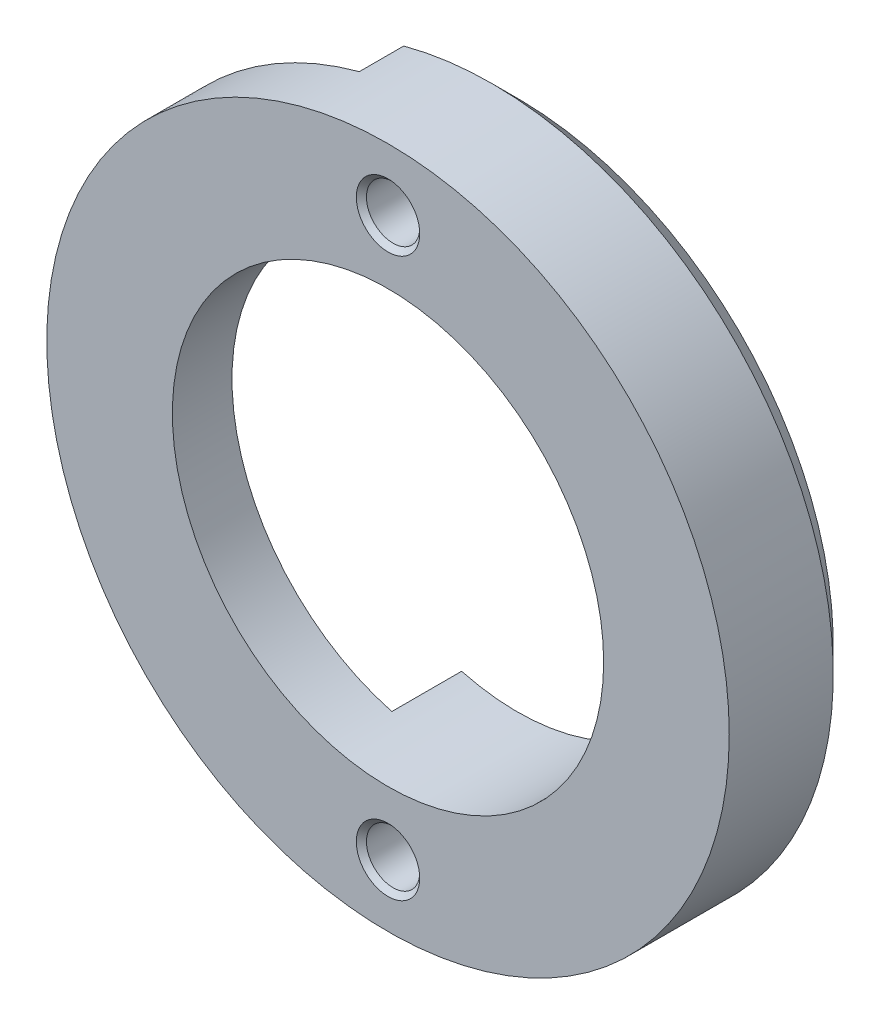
ISO-10303-21;
HEADER;
FILE_DESCRIPTION(('STEP AP214'),'2;1');
FILE_NAME('part.step','',(''),(''),'','','');
FILE_SCHEMA(('AUTOMOTIVE_DESIGN { 1 0 10303 214 1 1 1 1 }'));
ENDSEC;
DATA;
#1=APPLICATION_CONTEXT('core data for automotive mechanical design processes');
#2=APPLICATION_PROTOCOL_DEFINITION('international standard','automotive_design',2000,#1);
#3=PRODUCT_CONTEXT('',#1,'mechanical');
#4=PRODUCT('Part','Part','',(#3));
#5=PRODUCT_RELATED_PRODUCT_CATEGORY('part','',(#4));
#6=PRODUCT_DEFINITION_FORMATION('','',#4);
#7=PRODUCT_DEFINITION_CONTEXT('part definition',#1,'design');
#8=PRODUCT_DEFINITION('design','',#6,#7);
#9=PRODUCT_DEFINITION_SHAPE('','',#8);
#10=(LENGTH_UNIT() NAMED_UNIT(*) SI_UNIT(.MILLI.,.METRE.));
#11=(NAMED_UNIT(*) PLANE_ANGLE_UNIT() SI_UNIT($,.RADIAN.));
#12=(NAMED_UNIT(*) SI_UNIT($,.STERADIAN.) SOLID_ANGLE_UNIT());
#13=UNCERTAINTY_MEASURE_WITH_UNIT(LENGTH_MEASURE(1.E-05),#10,'distance_accuracy_value','');
#14=(GEOMETRIC_REPRESENTATION_CONTEXT(3) GLOBAL_UNCERTAINTY_ASSIGNED_CONTEXT((#13)) GLOBAL_UNIT_ASSIGNED_CONTEXT((#10,
#11,#12)) REPRESENTATION_CONTEXT('',''));
#15=CARTESIAN_POINT('',(0.,0.,0.));
#16=DIRECTION('',(0.,0.,1.));
#17=DIRECTION('',(1.,0.,0.));
#18=AXIS2_PLACEMENT_3D('',#15,#16,#17);
#19=CARTESIAN_POINT('',(0.,0.,0.));
#20=DIRECTION('',(0.,0.,1.));
#21=DIRECTION('',(1.,0.,0.));
#22=AXIS2_PLACEMENT_3D('',#19,#20,#21);
#23=PLANE('',#22);
#24=DIRECTION('',(0.258819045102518,0.965925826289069,0.));
#25=VECTOR('',#24,1.);
#26=CARTESIAN_POINT('',(-4.3999237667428,-16.4207390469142,0.));
#27=LINE('',#26,#25);
#28=CARTESIAN_POINT('',(-6.96223231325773,-25.983404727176,0.));
#29=VERTEX_POINT('',#28);
#30=CARTESIAN_POINT('',(-4.3999237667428,-16.4207390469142,0.));
#31=VERTEX_POINT('',#30);
#32=EDGE_CURVE('E95',#29,#31,#27,.T.);
#33=ORIENTED_EDGE('',*,*,#32,.F.);
#34=CARTESIAN_POINT('',(0.,0.,0.));
#35=DIRECTION('',(0.,0.,1.));
#36=DIRECTION('',(1.,0.,0.));
#37=AXIS2_PLACEMENT_3D('',#34,#35,#36);
#38=CIRCLE('',#37,26.9);
#39=CARTESIAN_POINT('',(-6.96223231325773,25.983404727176,0.));
#40=VERTEX_POINT('',#39);
#41=EDGE_CURVE('E83',#40,#29,#38,.T.);
#42=ORIENTED_EDGE('',*,*,#41,.F.);
#43=DIRECTION('',(-0.258819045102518,0.965925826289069,0.));
#44=VECTOR('',#43,1.);
#45=CARTESIAN_POINT('',(-4.3999237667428,16.4207390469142,0.));
#46=LINE('',#45,#44);
#47=CARTESIAN_POINT('',(-4.3999237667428,16.4207390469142,0.));
#48=VERTEX_POINT('',#47);
#49=EDGE_CURVE('E92',#48,#40,#46,.T.);
#50=ORIENTED_EDGE('',*,*,#49,.F.);
#51=CARTESIAN_POINT('',(0.,0.,0.));
#52=DIRECTION('',(0.,0.,1.));
#53=DIRECTION('',(1.,0.,0.));
#54=AXIS2_PLACEMENT_3D('',#51,#52,#53);
#55=CIRCLE('',#54,17.);
#56=EDGE_CURVE('E150',#48,#31,#55,.T.);
#57=ORIENTED_EDGE('',*,*,#56,.T.);
#58=EDGE_LOOP('',(#33,#42,#50,#57));
#59=FACE_BOUND('',#58,.T.);
#60=ADVANCED_FACE('F38',(#59),#23,.F.);
#61=CARTESIAN_POINT('',(0.,0.,4.7));
#62=DIRECTION('',(0.,0.,1.));
#63=DIRECTION('',(1.,0.,0.));
#64=AXIS2_PLACEMENT_3D('',#61,#62,#63);
#65=PLANE('',#64);
#66=CARTESIAN_POINT('',(0.,-22.,4.7));
#67=DIRECTION('',(0.,0.,1.));
#68=DIRECTION('',(1.,0.,0.));
#69=AXIS2_PLACEMENT_3D('',#66,#67,#68);
#70=CIRCLE('',#69,2.5);
#71=CARTESIAN_POINT('',(2.5,-22.,4.7));
#72=VERTEX_POINT('',#71);
#73=EDGE_CURVE('E290',#72,#72,#70,.T.);
#74=ORIENTED_EDGE('',*,*,#73,.F.);
#75=EDGE_LOOP('',(#74));
#76=FACE_BOUND('',#75,.T.);
#77=CARTESIAN_POINT('',(0.,22.,4.7));
#78=DIRECTION('',(0.,0.,1.));
#79=DIRECTION('',(1.,0.,0.));
#80=AXIS2_PLACEMENT_3D('',#77,#78,#79);
#81=CIRCLE('',#80,2.5);
#82=CARTESIAN_POINT('',(2.5,22.,4.7));
#83=VERTEX_POINT('',#82);
#84=EDGE_CURVE('E107',#83,#83,#81,.T.);
#85=ORIENTED_EDGE('',*,*,#84,.F.);
#86=EDGE_LOOP('',(#85));
#87=FACE_BOUND('',#86,.T.);
#88=CARTESIAN_POINT('',(0.,0.,4.7));
#89=DIRECTION('',(0.,0.,1.));
#90=DIRECTION('',(1.,0.,0.));
#91=AXIS2_PLACEMENT_3D('',#88,#89,#90);
#92=CIRCLE('',#91,26.9);
#93=CARTESIAN_POINT('',(26.9,0.,4.7));
#94=VERTEX_POINT('',#93);
#95=EDGE_CURVE('E96',#94,#94,#92,.T.);
#96=ORIENTED_EDGE('',*,*,#95,.T.);
#97=EDGE_LOOP('',(#96));
#98=FACE_BOUND('',#97,.T.);
#99=CARTESIAN_POINT('',(0.,0.,4.7));
#100=DIRECTION('',(0.,0.,1.));
#101=DIRECTION('',(1.,0.,0.));
#102=AXIS2_PLACEMENT_3D('',#99,#100,#101);
#103=CIRCLE('',#102,17.);
#104=CARTESIAN_POINT('',(17.,0.,4.7));
#105=VERTEX_POINT('',#104);
#106=EDGE_CURVE('E97',#105,#105,#103,.T.);
#107=ORIENTED_EDGE('',*,*,#106,.F.);
#108=EDGE_LOOP('',(#107));
#109=FACE_BOUND('',#108,.T.);
#110=ADVANCED_FACE('F157',(#76,#87,#98,#109),#65,.T.);
#111=CARTESIAN_POINT('',(0.,0.,4.7));
#112=DIRECTION('',(0.,0.,-1.));
#113=DIRECTION('',(-1.,0.,0.));
#114=AXIS2_PLACEMENT_3D('',#111,#112,#113);
#115=CYLINDRICAL_SURFACE('',#114,26.9);
#116=ORIENTED_EDGE('',*,*,#95,.F.);
#117=EDGE_LOOP('',(#116));
#118=FACE_BOUND('',#117,.T.);
#119=DIRECTION('',(0.,0.,1.));
#120=VECTOR('',#119,1.);
#121=CARTESIAN_POINT('',(-6.96223231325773,-25.983404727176,-5.5));
#122=LINE('',#121,#120);
#123=CARTESIAN_POINT('',(-6.96223231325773,-25.983404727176,-3.5));
#124=VERTEX_POINT('',#123);
#125=EDGE_CURVE('E88',#124,#29,#122,.T.);
#126=ORIENTED_EDGE('',*,*,#125,.F.);
#127=CARTESIAN_POINT('',(0.,0.,-3.5));
#128=DIRECTION('',(0.,0.,-1.));
#129=DIRECTION('',(-1.,0.,0.));
#130=AXIS2_PLACEMENT_3D('',#127,#128,#129);
#131=CIRCLE('',#130,26.9);
#132=CARTESIAN_POINT('',(-6.96223231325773,25.983404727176,-3.49999999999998));
#133=VERTEX_POINT('',#132);
#134=EDGE_CURVE('E46',#124,#133,#131,.F.);
#135=ORIENTED_EDGE('',*,*,#134,.T.);
#136=DIRECTION('',(0.,0.,1.));
#137=VECTOR('',#136,1.);
#138=CARTESIAN_POINT('',(-6.96223231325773,25.983404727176,-5.5));
#139=LINE('',#138,#137);
#140=EDGE_CURVE('E81',#133,#40,#139,.T.);
#141=ORIENTED_EDGE('',*,*,#140,.T.);
#142=ORIENTED_EDGE('',*,*,#41,.T.);
#143=EDGE_LOOP('',(#126,#135,#141,#142));
#144=FACE_BOUND('',#143,.T.);
#145=ADVANCED_FACE('F40',(#118,#144),#115,.T.);
#146=CARTESIAN_POINT('',(0.,0.,4.7));
#147=DIRECTION('',(0.,0.,-1.));
#148=DIRECTION('',(-1.,0.,0.));
#149=AXIS2_PLACEMENT_3D('',#146,#147,#148);
#150=CYLINDRICAL_SURFACE('',#149,17.);
#151=ORIENTED_EDGE('',*,*,#106,.T.);
#152=EDGE_LOOP('',(#151));
#153=FACE_BOUND('',#152,.T.);
#154=ORIENTED_EDGE('',*,*,#56,.F.);
#155=DIRECTION('',(0.,0.,1.));
#156=VECTOR('',#155,1.);
#157=CARTESIAN_POINT('',(-4.3999237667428,16.4207390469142,-5.5));
#158=LINE('',#157,#156);
#159=CARTESIAN_POINT('',(-4.3999237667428,16.4207390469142,-5.5));
#160=VERTEX_POINT('',#159);
#161=EDGE_CURVE('E87',#160,#48,#158,.T.);
#162=ORIENTED_EDGE('',*,*,#161,.F.);
#163=CARTESIAN_POINT('',(0.,0.,-5.5));
#164=DIRECTION('',(0.,0.,1.));
#165=DIRECTION('',(-1.,0.,0.));
#166=AXIS2_PLACEMENT_3D('',#163,#164,#165);
#167=CIRCLE('',#166,17.);
#168=CARTESIAN_POINT('',(-4.3999237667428,-16.4207390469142,-5.5));
#169=VERTEX_POINT('',#168);
#170=EDGE_CURVE('E104',#169,#160,#167,.T.);
#171=ORIENTED_EDGE('',*,*,#170,.F.);
#172=DIRECTION('',(0.,0.,1.));
#173=VECTOR('',#172,1.);
#174=CARTESIAN_POINT('',(-4.3999237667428,-16.4207390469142,-5.5));
#175=LINE('',#174,#173);
#176=EDGE_CURVE('E126',#169,#31,#175,.T.);
#177=ORIENTED_EDGE('',*,*,#176,.T.);
#178=EDGE_LOOP('',(#154,#162,#171,#177));
#179=FACE_BOUND('',#178,.T.);
#180=ADVANCED_FACE('F154',(#153,#179),#150,.F.);
#181=CARTESIAN_POINT('',(-4.3999237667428,16.4207390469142,-5.5));
#182=DIRECTION('',(0.965925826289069,0.258819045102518,0.));
#183=DIRECTION('',(-0.258819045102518,0.965925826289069,0.));
#184=AXIS2_PLACEMENT_3D('',#181,#182,#183);
#185=PLANE('',#184);
#186=ORIENTED_EDGE('',*,*,#140,.F.);
#187=DIRECTION('',(-0.183012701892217,0.68301270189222,0.707106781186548));
#188=VECTOR('',#187,1.);
#189=CARTESIAN_POINT('',(0.,0.,-30.4));
#190=LINE('',#189,#188);
#191=CARTESIAN_POINT('',(-6.4445942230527,24.0515530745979,-5.49999999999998));
#192=VERTEX_POINT('',#191);
#193=EDGE_CURVE('E11',#133,#192,#190,.F.);
#194=ORIENTED_EDGE('',*,*,#193,.T.);
#195=DIRECTION('',(-0.258819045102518,0.965925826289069,0.));
#196=VECTOR('',#195,1.);
#197=CARTESIAN_POINT('',(-4.3999237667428,16.4207390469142,-5.5));
#198=LINE('',#197,#196);
#199=EDGE_CURVE('E201',#160,#192,#198,.T.);
#200=ORIENTED_EDGE('',*,*,#199,.F.);
#201=ORIENTED_EDGE('',*,*,#161,.T.);
#202=ORIENTED_EDGE('',*,*,#49,.T.);
#203=EDGE_LOOP('',(#186,#194,#200,#201,#202));
#204=FACE_BOUND('',#203,.T.);
#205=ADVANCED_FACE('F100',(#204),#185,.F.);
#206=CARTESIAN_POINT('',(-4.3999237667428,-16.4207390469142,-5.5));
#207=DIRECTION('',(0.965925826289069,-0.258819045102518,0.));
#208=DIRECTION('',(0.258819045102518,0.965925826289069,0.));
#209=AXIS2_PLACEMENT_3D('',#206,#207,#208);
#210=PLANE('',#209);
#211=DIRECTION('',(0.258819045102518,0.965925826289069,0.));
#212=VECTOR('',#211,1.);
#213=CARTESIAN_POINT('',(-4.3999237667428,-16.4207390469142,-5.5));
#214=LINE('',#213,#212);
#215=CARTESIAN_POINT('',(-6.4445942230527,-24.0515530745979,-5.49999999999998));
#216=VERTEX_POINT('',#215);
#217=EDGE_CURVE('E129',#216,#169,#214,.T.);
#218=ORIENTED_EDGE('',*,*,#217,.F.);
#219=DIRECTION('',(0.183012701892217,0.68301270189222,-0.707106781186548));
#220=VECTOR('',#219,1.);
#221=CARTESIAN_POINT('',(0.,0.,-30.4));
#222=LINE('',#221,#220);
#223=EDGE_CURVE('E60',#216,#124,#222,.F.);
#224=ORIENTED_EDGE('',*,*,#223,.T.);
#225=ORIENTED_EDGE('',*,*,#125,.T.);
#226=ORIENTED_EDGE('',*,*,#32,.T.);
#227=ORIENTED_EDGE('',*,*,#176,.F.);
#228=EDGE_LOOP('',(#218,#224,#225,#226,#227));
#229=FACE_BOUND('',#228,.T.);
#230=ADVANCED_FACE('F173',(#229),#210,.F.);
#231=CARTESIAN_POINT('',(0.,0.,-5.5));
#232=DIRECTION('',(0.,0.,-1.));
#233=DIRECTION('',(-1.,0.,0.));
#234=AXIS2_PLACEMENT_3D('',#231,#232,#233);
#235=PLANE('',#234);
#236=CARTESIAN_POINT('',(0.,-22.,-5.5));
#237=DIRECTION('',(0.,0.,-1.));
#238=DIRECTION('',(-1.,0.,0.));
#239=AXIS2_PLACEMENT_3D('',#236,#237,#238);
#240=CIRCLE('',#239,2.1);
#241=CARTESIAN_POINT('',(-2.1,-22.,-5.5));
#242=VERTEX_POINT('',#241);
#243=EDGE_CURVE('E286',#242,#242,#240,.T.);
#244=ORIENTED_EDGE('',*,*,#243,.F.);
#245=EDGE_LOOP('',(#244));
#246=FACE_BOUND('',#245,.T.);
#247=CARTESIAN_POINT('',(0.,22.,-5.5));
#248=DIRECTION('',(0.,0.,-1.));
#249=DIRECTION('',(-1.,0.,0.));
#250=AXIS2_PLACEMENT_3D('',#247,#248,#249);
#251=CIRCLE('',#250,2.1);
#252=CARTESIAN_POINT('',(-2.1,22.,-5.5));
#253=VERTEX_POINT('',#252);
#254=EDGE_CURVE('E102',#253,#253,#251,.T.);
#255=ORIENTED_EDGE('',*,*,#254,.F.);
#256=EDGE_LOOP('',(#255));
#257=FACE_BOUND('',#256,.T.);
#258=ORIENTED_EDGE('',*,*,#199,.T.);
#259=CARTESIAN_POINT('',(0.,0.,-5.5));
#260=DIRECTION('',(0.,0.,-1.));
#261=DIRECTION('',(-1.,0.,0.));
#262=AXIS2_PLACEMENT_3D('',#259,#260,#261);
#263=CIRCLE('',#262,24.9);
#264=EDGE_CURVE('E137',#192,#216,#263,.T.);
#265=ORIENTED_EDGE('',*,*,#264,.T.);
#266=ORIENTED_EDGE('',*,*,#217,.T.);
#267=ORIENTED_EDGE('',*,*,#170,.T.);
#268=EDGE_LOOP('',(#258,#265,#266,#267));
#269=FACE_BOUND('',#268,.T.);
#270=ADVANCED_FACE('F176',(#246,#257,#269),#235,.T.);
#271=CARTESIAN_POINT('',(0.,22.,4.7));
#272=DIRECTION('',(0.,0.,1.));
#273=DIRECTION('',(1.,0.,0.));
#274=AXIS2_PLACEMENT_3D('',#271,#272,#273);
#275=CONICAL_SURFACE('',#274,2.5,0.785398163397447);
#276=CARTESIAN_POINT('',(0.,22.,4.3));
#277=DIRECTION('',(0.,0.,1.));
#278=DIRECTION('',(1.,0.,0.));
#279=AXIS2_PLACEMENT_3D('',#276,#277,#278);
#280=CIRCLE('',#279,2.1);
#281=CARTESIAN_POINT('',(2.1,22.,4.3));
#282=VERTEX_POINT('',#281);
#283=EDGE_CURVE('E294',#282,#282,#280,.T.);
#284=ORIENTED_EDGE('',*,*,#283,.F.);
#285=EDGE_LOOP('',(#284));
#286=FACE_BOUND('',#285,.T.);
#287=ORIENTED_EDGE('',*,*,#84,.T.);
#288=EDGE_LOOP('',(#287));
#289=FACE_BOUND('',#288,.T.);
#290=ADVANCED_FACE('F179',(#286,#289),#275,.F.);
#291=CARTESIAN_POINT('',(0.,22.,4.7));
#292=DIRECTION('',(0.,0.,1.));
#293=DIRECTION('',(1.,0.,0.));
#294=AXIS2_PLACEMENT_3D('',#291,#292,#293);
#295=CYLINDRICAL_SURFACE('',#294,2.1);
#296=ORIENTED_EDGE('',*,*,#254,.T.);
#297=EDGE_LOOP('',(#296));
#298=FACE_BOUND('',#297,.T.);
#299=ORIENTED_EDGE('',*,*,#283,.T.);
#300=EDGE_LOOP('',(#299));
#301=FACE_BOUND('',#300,.T.);
#302=ADVANCED_FACE('F183',(#298,#301),#295,.F.);
#303=CARTESIAN_POINT('',(0.,-22.,4.7));
#304=DIRECTION('',(0.,0.,1.));
#305=DIRECTION('',(1.,0.,0.));
#306=AXIS2_PLACEMENT_3D('',#303,#304,#305);
#307=CONICAL_SURFACE('',#306,2.5,0.785398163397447);
#308=CARTESIAN_POINT('',(0.,-22.,4.3));
#309=DIRECTION('',(0.,0.,1.));
#310=DIRECTION('',(1.,0.,0.));
#311=AXIS2_PLACEMENT_3D('',#308,#309,#310);
#312=CIRCLE('',#311,2.1);
#313=CARTESIAN_POINT('',(2.1,-22.,4.3));
#314=VERTEX_POINT('',#313);
#315=EDGE_CURVE('E289',#314,#314,#312,.T.);
#316=ORIENTED_EDGE('',*,*,#315,.F.);
#317=EDGE_LOOP('',(#316));
#318=FACE_BOUND('',#317,.T.);
#319=ORIENTED_EDGE('',*,*,#73,.T.);
#320=EDGE_LOOP('',(#319));
#321=FACE_BOUND('',#320,.T.);
#322=ADVANCED_FACE('F187',(#318,#321),#307,.F.);
#323=CARTESIAN_POINT('',(0.,-22.,4.7));
#324=DIRECTION('',(0.,0.,1.));
#325=DIRECTION('',(1.,0.,0.));
#326=AXIS2_PLACEMENT_3D('',#323,#324,#325);
#327=CYLINDRICAL_SURFACE('',#326,2.1);
#328=ORIENTED_EDGE('',*,*,#243,.T.);
#329=EDGE_LOOP('',(#328));
#330=FACE_BOUND('',#329,.T.);
#331=ORIENTED_EDGE('',*,*,#315,.T.);
#332=EDGE_LOOP('',(#331));
#333=FACE_BOUND('',#332,.T.);
#334=ADVANCED_FACE('F191',(#330,#333),#327,.F.);
#335=CARTESIAN_POINT('',(0.,0.,-5.5));
#336=DIRECTION('',(0.,0.,1.));
#337=DIRECTION('',(1.,0.,0.));
#338=AXIS2_PLACEMENT_3D('',#335,#336,#337);
#339=CONICAL_SURFACE('',#338,24.9,0.785398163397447);
#340=ORIENTED_EDGE('',*,*,#193,.F.);
#341=ORIENTED_EDGE('',*,*,#134,.F.);
#342=ORIENTED_EDGE('',*,*,#223,.F.);
#343=ORIENTED_EDGE('',*,*,#264,.F.);
#344=EDGE_LOOP('',(#340,#341,#342,#343));
#345=FACE_BOUND('',#344,.T.);
#346=ADVANCED_FACE('F195',(#345),#339,.T.);
#347=CLOSED_SHELL('',(#60,#110,#145,#180,#205,#230,#270,#290,#302,#322,#334,#346));
#348=MANIFOLD_SOLID_BREP('B2',#347);
#349=ADVANCED_BREP_SHAPE_REPRESENTATION('',(#18,#348),#14);
#350=SHAPE_DEFINITION_REPRESENTATION(#9,#349);
ENDSEC;
END-ISO-10303-21;
